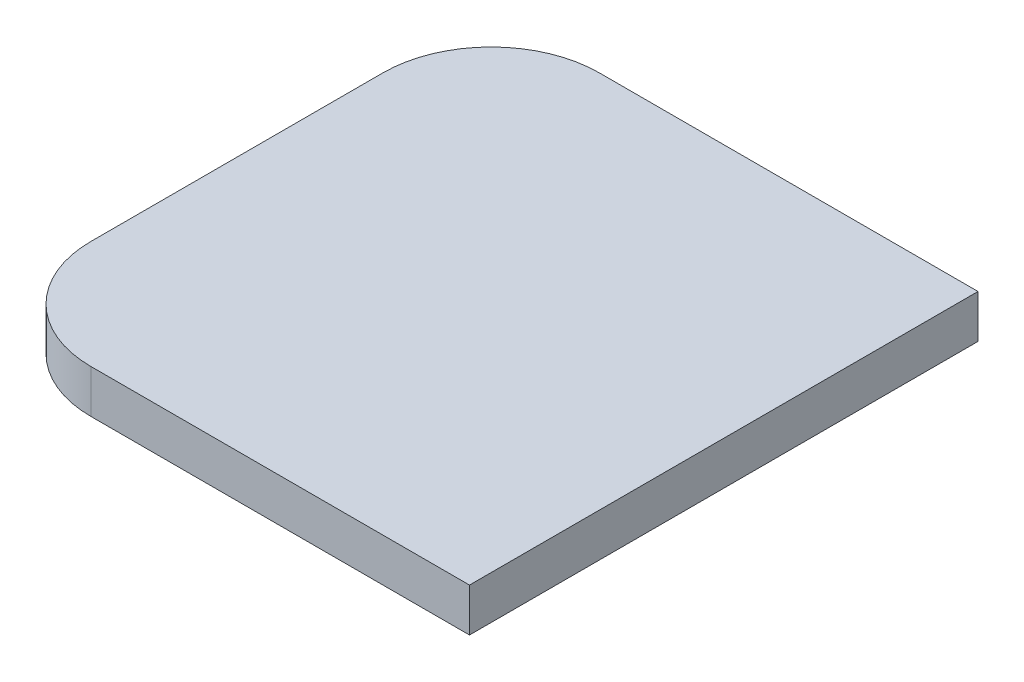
ISO-10303-21;
HEADER;
FILE_DESCRIPTION(('STEP AP214'),'2;1');
FILE_NAME('part.step','',(''),(''),'','','');
FILE_SCHEMA(('AUTOMOTIVE_DESIGN { 1 0 10303 214 1 1 1 1 }'));
ENDSEC;
DATA;
#1=APPLICATION_CONTEXT('core data for automotive mechanical design processes');
#2=APPLICATION_PROTOCOL_DEFINITION('international standard','automotive_design',2000,#1);
#3=PRODUCT_CONTEXT('',#1,'mechanical');
#4=PRODUCT('Part','Part','',(#3));
#5=PRODUCT_RELATED_PRODUCT_CATEGORY('part','',(#4));
#6=PRODUCT_DEFINITION_FORMATION('','',#4);
#7=PRODUCT_DEFINITION_CONTEXT('part definition',#1,'design');
#8=PRODUCT_DEFINITION('design','',#6,#7);
#9=PRODUCT_DEFINITION_SHAPE('','',#8);
#10=(LENGTH_UNIT() NAMED_UNIT(*) SI_UNIT(.MILLI.,.METRE.));
#11=(NAMED_UNIT(*) PLANE_ANGLE_UNIT() SI_UNIT($,.RADIAN.));
#12=(NAMED_UNIT(*) SI_UNIT($,.STERADIAN.) SOLID_ANGLE_UNIT());
#13=UNCERTAINTY_MEASURE_WITH_UNIT(LENGTH_MEASURE(1.E-05),#10,'distance_accuracy_value','');
#14=(GEOMETRIC_REPRESENTATION_CONTEXT(3) GLOBAL_UNCERTAINTY_ASSIGNED_CONTEXT((#13)) GLOBAL_UNIT_ASSIGNED_CONTEXT((#10,
#11,#12)) REPRESENTATION_CONTEXT('',''));
#15=CARTESIAN_POINT('',(0.,0.,0.));
#16=DIRECTION('',(0.,0.,1.));
#17=DIRECTION('',(1.,0.,0.));
#18=AXIS2_PLACEMENT_3D('',#15,#16,#17);
#19=CARTESIAN_POINT('',(2.25,0.4,2.35));
#20=DIRECTION('',(-1.,0.,0.));
#21=DIRECTION('',(0.,0.,1.));
#22=AXIS2_PLACEMENT_3D('',#19,#20,#21);
#23=PLANE('',#22);
#24=DIRECTION('',(0.,0.,-1.));
#25=VECTOR('',#24,1.);
#26=CARTESIAN_POINT('',(2.25,0.,2.35));
#27=LINE('',#26,#25);
#28=CARTESIAN_POINT('',(2.25,0.,2.35));
#29=VERTEX_POINT('',#28);
#30=CARTESIAN_POINT('',(2.25,0.,-2.35));
#31=VERTEX_POINT('',#30);
#32=EDGE_CURVE('E108',#29,#31,#27,.T.);
#33=ORIENTED_EDGE('',*,*,#32,.T.);
#34=DIRECTION('',(0.,-1.,0.));
#35=VECTOR('',#34,1.);
#36=CARTESIAN_POINT('',(2.25,0.4,-2.35));
#37=LINE('',#36,#35);
#38=CARTESIAN_POINT('',(2.25,0.4,-2.35));
#39=VERTEX_POINT('',#38);
#40=EDGE_CURVE('E93',#39,#31,#37,.T.);
#41=ORIENTED_EDGE('',*,*,#40,.F.);
#42=DIRECTION('',(0.,0.,-1.));
#43=VECTOR('',#42,1.);
#44=CARTESIAN_POINT('',(2.25,0.4,2.35));
#45=LINE('',#44,#43);
#46=CARTESIAN_POINT('',(2.25,0.4,2.35));
#47=VERTEX_POINT('',#46);
#48=EDGE_CURVE('E97',#47,#39,#45,.T.);
#49=ORIENTED_EDGE('',*,*,#48,.F.);
#50=DIRECTION('',(0.,-1.,0.));
#51=VECTOR('',#50,1.);
#52=CARTESIAN_POINT('',(2.25,0.4,2.35));
#53=LINE('',#52,#51);
#54=EDGE_CURVE('E110',#47,#29,#53,.T.);
#55=ORIENTED_EDGE('',*,*,#54,.T.);
#56=EDGE_LOOP('',(#33,#41,#49,#55));
#57=FACE_BOUND('',#56,.T.);
#58=ADVANCED_FACE('F36',(#57),#23,.F.);
#59=CARTESIAN_POINT('',(-2.25,0.4,-2.35));
#60=DIRECTION('',(0.,0.,1.));
#61=DIRECTION('',(1.,0.,0.));
#62=AXIS2_PLACEMENT_3D('',#59,#60,#61);
#63=PLANE('',#62);
#64=DIRECTION('',(-1.,0.,0.));
#65=VECTOR('',#64,1.);
#66=CARTESIAN_POINT('',(-2.25,0.,-2.35));
#67=LINE('',#66,#65);
#68=CARTESIAN_POINT('',(-1.25,0.,-2.35));
#69=VERTEX_POINT('',#68);
#70=EDGE_CURVE('E136',#31,#69,#67,.T.);
#71=ORIENTED_EDGE('',*,*,#70,.T.);
#72=DIRECTION('',(0.,-1.,0.));
#73=VECTOR('',#72,1.);
#74=CARTESIAN_POINT('',(-1.25,0.4,-2.35));
#75=LINE('',#74,#73);
#76=CARTESIAN_POINT('',(-1.25,0.4,-2.35));
#77=VERTEX_POINT('',#76);
#78=EDGE_CURVE('E59',#69,#77,#75,.F.);
#79=ORIENTED_EDGE('',*,*,#78,.T.);
#80=DIRECTION('',(-1.,0.,0.));
#81=VECTOR('',#80,1.);
#82=CARTESIAN_POINT('',(-2.25,0.4,-2.35));
#83=LINE('',#82,#81);
#84=EDGE_CURVE('E89',#39,#77,#83,.T.);
#85=ORIENTED_EDGE('',*,*,#84,.F.);
#86=ORIENTED_EDGE('',*,*,#40,.T.);
#87=EDGE_LOOP('',(#71,#79,#85,#86));
#88=FACE_BOUND('',#87,.T.);
#89=ADVANCED_FACE('F91',(#88),#63,.F.);
#90=CARTESIAN_POINT('',(-2.25,0.4,2.35));
#91=DIRECTION('',(1.,0.,0.));
#92=DIRECTION('',(0.,0.,-1.));
#93=AXIS2_PLACEMENT_3D('',#90,#91,#92);
#94=PLANE('',#93);
#95=DIRECTION('',(0.,0.,1.));
#96=VECTOR('',#95,1.);
#97=CARTESIAN_POINT('',(-2.25,0.4,2.35));
#98=LINE('',#97,#96);
#99=CARTESIAN_POINT('',(-2.25,0.4,-1.35));
#100=VERTEX_POINT('',#99);
#101=CARTESIAN_POINT('',(-2.25,0.4,1.35));
#102=VERTEX_POINT('',#101);
#103=EDGE_CURVE('E96',#100,#102,#98,.T.);
#104=ORIENTED_EDGE('',*,*,#103,.F.);
#105=DIRECTION('',(0.,-1.,0.));
#106=VECTOR('',#105,1.);
#107=CARTESIAN_POINT('',(-2.25,0.4,-1.35));
#108=LINE('',#107,#106);
#109=CARTESIAN_POINT('',(-2.25,0.,-1.35));
#110=VERTEX_POINT('',#109);
#111=EDGE_CURVE('E112',#100,#110,#108,.T.);
#112=ORIENTED_EDGE('',*,*,#111,.T.);
#113=DIRECTION('',(0.,0.,1.));
#114=VECTOR('',#113,1.);
#115=CARTESIAN_POINT('',(-2.25,0.,2.35));
#116=LINE('',#115,#114);
#117=CARTESIAN_POINT('',(-2.25,0.,1.35));
#118=VERTEX_POINT('',#117);
#119=EDGE_CURVE('E137',#110,#118,#116,.T.);
#120=ORIENTED_EDGE('',*,*,#119,.T.);
#121=DIRECTION('',(0.,-1.,0.));
#122=VECTOR('',#121,1.);
#123=CARTESIAN_POINT('',(-2.25,0.4,1.35));
#124=LINE('',#123,#122);
#125=EDGE_CURVE('E109',#118,#102,#124,.F.);
#126=ORIENTED_EDGE('',*,*,#125,.T.);
#127=EDGE_LOOP('',(#104,#112,#120,#126));
#128=FACE_BOUND('',#127,.T.);
#129=ADVANCED_FACE('F128',(#128),#94,.F.);
#130=CARTESIAN_POINT('',(-2.25,0.4,2.35));
#131=DIRECTION('',(0.,0.,-1.));
#132=DIRECTION('',(-1.,0.,0.));
#133=AXIS2_PLACEMENT_3D('',#130,#131,#132);
#134=PLANE('',#133);
#135=DIRECTION('',(1.,0.,0.));
#136=VECTOR('',#135,1.);
#137=CARTESIAN_POINT('',(-2.25,0.4,2.35));
#138=LINE('',#137,#136);
#139=CARTESIAN_POINT('',(-1.25,0.4,2.35));
#140=VERTEX_POINT('',#139);
#141=EDGE_CURVE('E101',#140,#47,#138,.T.);
#142=ORIENTED_EDGE('',*,*,#141,.F.);
#143=DIRECTION('',(0.,-1.,0.));
#144=VECTOR('',#143,1.);
#145=CARTESIAN_POINT('',(-1.25,0.4,2.35));
#146=LINE('',#145,#144);
#147=CARTESIAN_POINT('',(-1.25,0.,2.35));
#148=VERTEX_POINT('',#147);
#149=EDGE_CURVE('E11',#140,#148,#146,.T.);
#150=ORIENTED_EDGE('',*,*,#149,.T.);
#151=DIRECTION('',(1.,0.,0.));
#152=VECTOR('',#151,1.);
#153=CARTESIAN_POINT('',(-2.25,0.,2.35));
#154=LINE('',#153,#152);
#155=EDGE_CURVE('E105',#148,#29,#154,.T.);
#156=ORIENTED_EDGE('',*,*,#155,.T.);
#157=ORIENTED_EDGE('',*,*,#54,.F.);
#158=EDGE_LOOP('',(#142,#150,#156,#157));
#159=FACE_BOUND('',#158,.T.);
#160=ADVANCED_FACE('F144',(#159),#134,.F.);
#161=CARTESIAN_POINT('',(0.,0.4,0.));
#162=DIRECTION('',(0.,-1.,0.));
#163=DIRECTION('',(0.,0.,-1.));
#164=AXIS2_PLACEMENT_3D('',#161,#162,#163);
#165=PLANE('',#164);
#166=ORIENTED_EDGE('',*,*,#84,.T.);
#167=CARTESIAN_POINT('',(-1.25,0.4,-1.35));
#168=DIRECTION('',(0.,-1.,0.));
#169=DIRECTION('',(0.,0.,-1.));
#170=AXIS2_PLACEMENT_3D('',#167,#168,#169);
#171=CIRCLE('',#170,1.);
#172=EDGE_CURVE('E44',#77,#100,#171,.F.);
#173=ORIENTED_EDGE('',*,*,#172,.T.);
#174=ORIENTED_EDGE('',*,*,#103,.T.);
#175=CARTESIAN_POINT('',(-1.25,0.4,1.35));
#176=DIRECTION('',(0.,-1.,0.));
#177=DIRECTION('',(0.,0.,-1.));
#178=AXIS2_PLACEMENT_3D('',#175,#176,#177);
#179=CIRCLE('',#178,1.);
#180=EDGE_CURVE('E51',#102,#140,#179,.F.);
#181=ORIENTED_EDGE('',*,*,#180,.T.);
#182=ORIENTED_EDGE('',*,*,#141,.T.);
#183=ORIENTED_EDGE('',*,*,#48,.T.);
#184=EDGE_LOOP('',(#166,#173,#174,#181,#182,#183));
#185=FACE_BOUND('',#184,.T.);
#186=ADVANCED_FACE('F100',(#185),#165,.F.);
#187=CARTESIAN_POINT('',(0.,0.,0.));
#188=DIRECTION('',(0.,-1.,0.));
#189=DIRECTION('',(0.,0.,-1.));
#190=AXIS2_PLACEMENT_3D('',#187,#188,#189);
#191=PLANE('',#190);
#192=ORIENTED_EDGE('',*,*,#119,.F.);
#193=CARTESIAN_POINT('',(-1.25,0.,-1.35));
#194=DIRECTION('',(0.,-1.,0.));
#195=DIRECTION('',(0.,0.,-1.));
#196=AXIS2_PLACEMENT_3D('',#193,#194,#195);
#197=CIRCLE('',#196,1.);
#198=EDGE_CURVE('E121',#110,#69,#197,.T.);
#199=ORIENTED_EDGE('',*,*,#198,.T.);
#200=ORIENTED_EDGE('',*,*,#70,.F.);
#201=ORIENTED_EDGE('',*,*,#32,.F.);
#202=ORIENTED_EDGE('',*,*,#155,.F.);
#203=CARTESIAN_POINT('',(-1.25,0.,1.35));
#204=DIRECTION('',(0.,-1.,0.));
#205=DIRECTION('',(0.,0.,-1.));
#206=AXIS2_PLACEMENT_3D('',#203,#204,#205);
#207=CIRCLE('',#206,1.);
#208=EDGE_CURVE('E119',#148,#118,#207,.T.);
#209=ORIENTED_EDGE('',*,*,#208,.T.);
#210=EDGE_LOOP('',(#192,#199,#200,#201,#202,#209));
#211=FACE_BOUND('',#210,.T.);
#212=ADVANCED_FACE('F135',(#211),#191,.T.);
#213=CARTESIAN_POINT('',(-1.25,0.4,-1.35));
#214=DIRECTION('',(0.,-1.,0.));
#215=DIRECTION('',(0.,0.,-1.));
#216=AXIS2_PLACEMENT_3D('',#213,#214,#215);
#217=CYLINDRICAL_SURFACE('',#216,1.);
#218=ORIENTED_EDGE('',*,*,#172,.F.);
#219=ORIENTED_EDGE('',*,*,#78,.F.);
#220=ORIENTED_EDGE('',*,*,#198,.F.);
#221=ORIENTED_EDGE('',*,*,#111,.F.);
#222=EDGE_LOOP('',(#218,#219,#220,#221));
#223=FACE_BOUND('',#222,.T.);
#224=ADVANCED_FACE('F133',(#223),#217,.T.);
#225=CARTESIAN_POINT('',(-1.25,0.4,1.35));
#226=DIRECTION('',(0.,-1.,0.));
#227=DIRECTION('',(0.,0.,-1.));
#228=AXIS2_PLACEMENT_3D('',#225,#226,#227);
#229=CYLINDRICAL_SURFACE('',#228,1.);
#230=ORIENTED_EDGE('',*,*,#180,.F.);
#231=ORIENTED_EDGE('',*,*,#125,.F.);
#232=ORIENTED_EDGE('',*,*,#208,.F.);
#233=ORIENTED_EDGE('',*,*,#149,.F.);
#234=EDGE_LOOP('',(#230,#231,#232,#233));
#235=FACE_BOUND('',#234,.T.);
#236=ADVANCED_FACE('F38',(#235),#229,.T.);
#237=CLOSED_SHELL('',(#58,#89,#129,#160,#186,#212,#224,#236));
#238=MANIFOLD_SOLID_BREP('B2',#237);
#239=ADVANCED_BREP_SHAPE_REPRESENTATION('',(#18,#238),#14);
#240=SHAPE_DEFINITION_REPRESENTATION(#9,#239);
ENDSEC;
END-ISO-10303-21;
